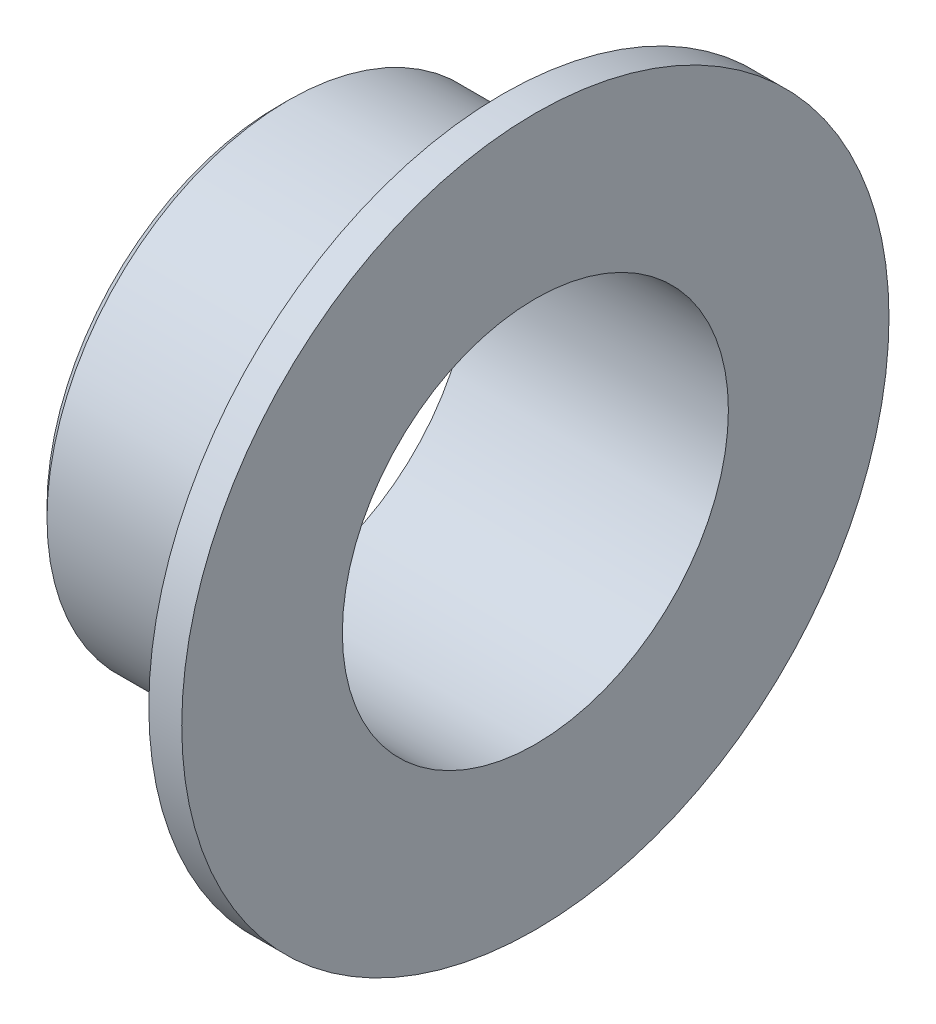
from build123d import *

# Parameters (mm, degrees)
CHAMFER1_SIZE = 0.254


with BuildPart() as part:
    # Sketch1 → Base-Revolve (revolve)
    with BuildSketch(Plane.XY, mode=Mode.PRIVATE) as base_revolve_sk:
        Polygon((0, -4.7625), (6.35, -4.7625), (6.35, -8.7249), (5.5372, -8.7249), (5.5372, -5.953125), (0, -5.953125), align=None)
    revolve(base_revolve_sk.sketch.rotate(Axis((0, 0, 0), (1, 0, 0)), 270), axis=Axis((0, 0, 0), (1, 0, 0)))

    # Chamfer1
    chamfer1_edges = [part.edges().sort_by_distance(p)[0] for p in [
        (0, 0, -5.953125),
    ]]
    chamfer(chamfer1_edges, length=CHAMFER1_SIZE)


solid = part.part
